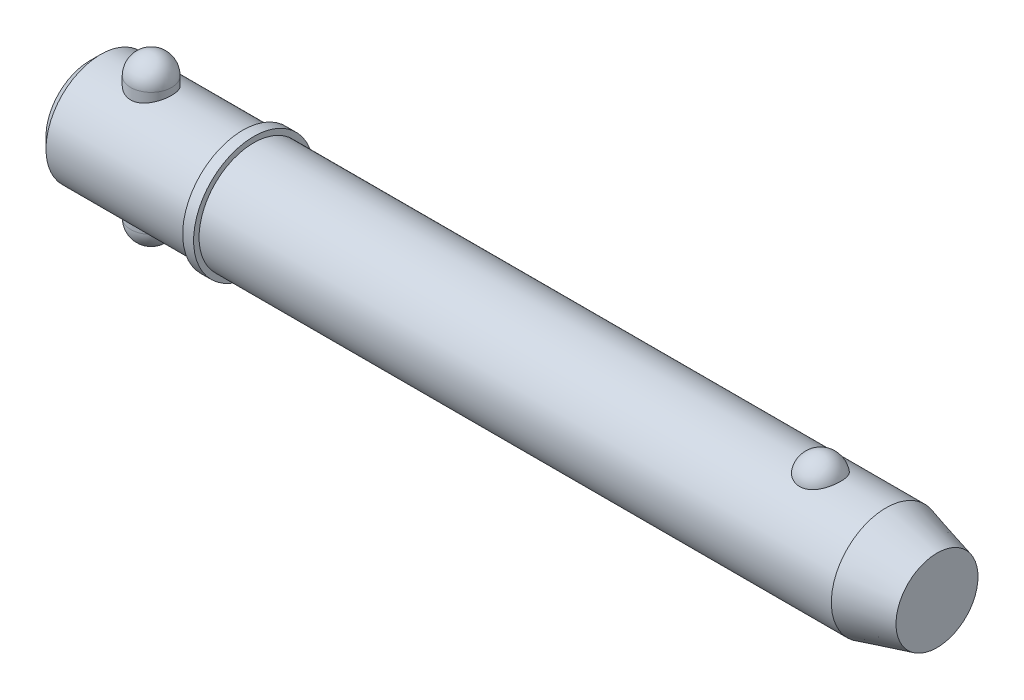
ISO-10303-21;
HEADER;
FILE_DESCRIPTION(('STEP AP214'),'2;1');
FILE_NAME('part.step','',(''),(''),'','','');
FILE_SCHEMA(('AUTOMOTIVE_DESIGN { 1 0 10303 214 1 1 1 1 }'));
ENDSEC;
DATA;
#1=APPLICATION_CONTEXT('core data for automotive mechanical design processes');
#2=APPLICATION_PROTOCOL_DEFINITION('international standard','automotive_design',2000,#1);
#3=PRODUCT_CONTEXT('',#1,'mechanical');
#4=PRODUCT('Part','Part','',(#3));
#5=PRODUCT_RELATED_PRODUCT_CATEGORY('part','',(#4));
#6=PRODUCT_DEFINITION_FORMATION('','',#4);
#7=PRODUCT_DEFINITION_CONTEXT('part definition',#1,'design');
#8=PRODUCT_DEFINITION('design','',#6,#7);
#9=PRODUCT_DEFINITION_SHAPE('','',#8);
#10=(LENGTH_UNIT() NAMED_UNIT(*) SI_UNIT(.MILLI.,.METRE.));
#11=(NAMED_UNIT(*) PLANE_ANGLE_UNIT() SI_UNIT($,.RADIAN.));
#12=(NAMED_UNIT(*) SI_UNIT($,.STERADIAN.) SOLID_ANGLE_UNIT());
#13=UNCERTAINTY_MEASURE_WITH_UNIT(LENGTH_MEASURE(1.E-05),#10,'distance_accuracy_value','');
#14=(GEOMETRIC_REPRESENTATION_CONTEXT(3) GLOBAL_UNCERTAINTY_ASSIGNED_CONTEXT((#13)) GLOBAL_UNIT_ASSIGNED_CONTEXT((#10,
#11,#12)) REPRESENTATION_CONTEXT('',''));
#15=CARTESIAN_POINT('',(0.,0.,0.));
#16=DIRECTION('',(0.,0.,1.));
#17=DIRECTION('',(1.,0.,0.));
#18=AXIS2_PLACEMENT_3D('',#15,#16,#17);
#19=CARTESIAN_POINT('',(14.28,19.05,0.));
#20=DIRECTION('',(0.,-1.,0.));
#21=DIRECTION('',(0.,0.,-1.));
#22=AXIS2_PLACEMENT_3D('',#19,#20,#21);
#23=CYLINDRICAL_SURFACE('',#22,4.76);
#24=CARTESIAN_POINT('',(14.28,-14.29,0.));
#25=DIRECTION('',(0.,-1.,0.));
#26=DIRECTION('',(0.,0.,-1.));
#27=AXIS2_PLACEMENT_3D('',#24,#25,#26);
#28=CIRCLE('',#27,4.76);
#29=CARTESIAN_POINT('',(14.28,-14.29,-4.76));
#30=VERTEX_POINT('',#29);
#31=EDGE_CURVE('P0_E10',#30,#30,#28,.F.);
#32=CARTESIAN_POINT('',(14.28,14.29,0.));
#33=DIRECTION('',(0.,-1.,0.));
#34=DIRECTION('',(0.,0.,-1.));
#35=AXIS2_PLACEMENT_3D('',#32,#33,#34);
#36=CIRCLE('',#35,4.76);
#37=CARTESIAN_POINT('',(14.28,14.29,-4.76));
#38=VERTEX_POINT('',#37);
#39=EDGE_CURVE('P0_E21',#38,#38,#36,.T.);
#40=CARTESIAN_POINT('',(14.28,-14.29,-4.76));
#41=CARTESIAN_POINT('',(14.28,-13.9922916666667,-4.76));
#42=CARTESIAN_POINT('',(14.28,-13.6945833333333,-4.76));
#43=CARTESIAN_POINT('',(14.28,-13.0991666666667,-4.76));
#44=CARTESIAN_POINT('',(14.28,-12.8014583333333,-4.76));
#45=CARTESIAN_POINT('',(14.28,-12.2060416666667,-4.76));
#46=CARTESIAN_POINT('',(14.28,-11.9083333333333,-4.76));
#47=CARTESIAN_POINT('',(14.28,-11.3129166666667,-4.76));
#48=CARTESIAN_POINT('',(14.28,-11.0152083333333,-4.76));
#49=CARTESIAN_POINT('',(14.28,-10.4197916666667,-4.76));
#50=CARTESIAN_POINT('',(14.28,-10.1220833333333,-4.76));
#51=CARTESIAN_POINT('',(14.28,-9.52666666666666,-4.76));
#52=CARTESIAN_POINT('',(14.28,-9.22895833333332,-4.76));
#53=CARTESIAN_POINT('',(14.28,-8.63354166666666,-4.76));
#54=CARTESIAN_POINT('',(14.28,-8.33583333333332,-4.76));
#55=CARTESIAN_POINT('',(14.28,-7.74041666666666,-4.76));
#56=CARTESIAN_POINT('',(14.28,-7.44270833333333,-4.76));
#57=CARTESIAN_POINT('',(14.28,-6.84729166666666,-4.76));
#58=CARTESIAN_POINT('',(14.28,-6.54958333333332,-4.76));
#59=CARTESIAN_POINT('',(14.28,-5.95416666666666,-4.76));
#60=CARTESIAN_POINT('',(14.28,-5.65645833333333,-4.76));
#61=CARTESIAN_POINT('',(14.28,-5.06104166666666,-4.76));
#62=CARTESIAN_POINT('',(14.28,-4.76333333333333,-4.76));
#63=CARTESIAN_POINT('',(14.28,-4.16791666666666,-4.76));
#64=CARTESIAN_POINT('',(14.28,-3.87020833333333,-4.76));
#65=CARTESIAN_POINT('',(14.28,-3.27479166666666,-4.76));
#66=CARTESIAN_POINT('',(14.28,-2.97708333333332,-4.76));
#67=CARTESIAN_POINT('',(14.28,-2.38166666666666,-4.76));
#68=CARTESIAN_POINT('',(14.28,-2.08395833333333,-4.76));
#69=CARTESIAN_POINT('',(14.28,-1.48854166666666,-4.76));
#70=CARTESIAN_POINT('',(14.28,-1.19083333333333,-4.76));
#71=CARTESIAN_POINT('',(14.28,-0.595416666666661,-4.76));
#72=CARTESIAN_POINT('',(14.28,-0.297708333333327,-4.76));
#73=CARTESIAN_POINT('',(14.28,0.297708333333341,-4.76));
#74=CARTESIAN_POINT('',(14.28,0.595416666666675,-4.76));
#75=CARTESIAN_POINT('',(14.28,1.19083333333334,-4.76));
#76=CARTESIAN_POINT('',(14.28,1.48854166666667,-4.76));
#77=CARTESIAN_POINT('',(14.28,2.08395833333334,-4.76));
#78=CARTESIAN_POINT('',(14.28,2.38166666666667,-4.76));
#79=CARTESIAN_POINT('',(14.28,2.97708333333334,-4.76));
#80=CARTESIAN_POINT('',(14.28,3.27479166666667,-4.76));
#81=CARTESIAN_POINT('',(14.28,3.87020833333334,-4.76));
#82=CARTESIAN_POINT('',(14.28,4.16791666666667,-4.76));
#83=CARTESIAN_POINT('',(14.28,4.76333333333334,-4.76));
#84=CARTESIAN_POINT('',(14.28,5.06104166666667,-4.76));
#85=CARTESIAN_POINT('',(14.28,5.65645833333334,-4.76));
#86=CARTESIAN_POINT('',(14.28,5.95416666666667,-4.76));
#87=CARTESIAN_POINT('',(14.28,6.54958333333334,-4.76));
#88=CARTESIAN_POINT('',(14.28,6.84729166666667,-4.76));
#89=CARTESIAN_POINT('',(14.28,7.44270833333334,-4.76));
#90=CARTESIAN_POINT('',(14.28,7.74041666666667,-4.76));
#91=CARTESIAN_POINT('',(14.28,8.33583333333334,-4.76));
#92=CARTESIAN_POINT('',(14.28,8.63354166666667,-4.76));
#93=CARTESIAN_POINT('',(14.28,9.22895833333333,-4.76));
#94=CARTESIAN_POINT('',(14.28,9.52666666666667,-4.76));
#95=CARTESIAN_POINT('',(14.28,10.1220833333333,-4.76));
#96=CARTESIAN_POINT('',(14.28,10.4197916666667,-4.76));
#97=CARTESIAN_POINT('',(14.28,11.0152083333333,-4.76));
#98=CARTESIAN_POINT('',(14.28,11.3129166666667,-4.76));
#99=CARTESIAN_POINT('',(14.28,11.9083333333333,-4.76));
#100=CARTESIAN_POINT('',(14.28,12.2060416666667,-4.76));
#101=CARTESIAN_POINT('',(14.28,12.8014583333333,-4.76));
#102=CARTESIAN_POINT('',(14.28,13.0991666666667,-4.76));
#103=CARTESIAN_POINT('',(14.28,13.6945833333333,-4.76));
#104=CARTESIAN_POINT('',(14.28,13.9922916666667,-4.76));
#105=CARTESIAN_POINT('',(14.28,14.29,-4.76));
#106=B_SPLINE_CURVE_WITH_KNOTS('',3,(#40,#41,#42,#43,#44,#45,#46,#47,#48,#49,#50,#51,#52,#53,
#54,#55,#56,#57,#58,#59,#60,#61,#62,#63,#64,#65,#66,#67,#68,#69,#70,#71,#72,#73,#74,#75,#76,#77,
#78,#79,#80,#81,#82,#83,#84,#85,#86,#87,#88,#89,#90,#91,#92,#93,#94,#95,#96,#97,#98,#99,#100,
#101,#102,#103,#104,#105),.UNSPECIFIED.,.F.,.F.,(4,2,2,2,2,2,2,2,2,2,2,2,2,2,2,2,2,2,2,2,2,2,2,
2,2,2,2,2,2,2,2,2,4),(0.,0.893125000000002,1.78625,2.67937499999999,3.5725,4.465625,5.35875,
6.25187499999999,7.145,8.038125,8.93125,9.82437499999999,10.7175,11.610625,12.50375,13.396875,
14.29,15.183125,16.07625,16.969375,17.8625,18.755625,19.64875,20.541875,21.435,22.328125,
23.22125,24.114375,25.0075,25.900625,26.79375,27.686875,28.58),.UNSPECIFIED.);
#107=EDGE_CURVE('P0_BSEAM14',#30,#38,#106,.T.);
#108=ORIENTED_EDGE('',*,*,#31,.T.);
#109=ORIENTED_EDGE('',*,*,#39,.T.);
#110=ORIENTED_EDGE('',*,*,#107,.T.);
#111=ORIENTED_EDGE('',*,*,#107,.F.);
#112=EDGE_LOOP('',(#108,#110,#109,#111));
#113=FACE_BOUND('',#112,.T.);
#114=ADVANCED_FACE('P0_F14',(#113),#23,.T.);
#115=CARTESIAN_POINT('',(14.28,-14.29,0.));
#116=DIRECTION('',(0.,0.,1.));
#117=DIRECTION('',(1.,0.,0.));
#118=AXIS2_PLACEMENT_3D('',#115,#116,#117);
#119=SPHERICAL_SURFACE('',#118,4.76);
#120=CARTESIAN_POINT('',(14.28,-14.29,0.));
#121=DIRECTION('',(0.,-1.,0.));
#122=DIRECTION('',(0.,0.,-1.));
#123=AXIS2_PLACEMENT_3D('',#120,#121,#122);
#124=SPHERICAL_SURFACE('',#123,4.76);
#125=ORIENTED_EDGE('',*,*,#31,.F.);
#126=EDGE_LOOP('',(#125));
#127=FACE_BOUND('',#126,.T.);
#128=ADVANCED_FACE('P0_F29',(#127),#124,.T.);
#129=CARTESIAN_POINT('',(14.28,14.29,0.));
#130=DIRECTION('',(0.,0.,1.));
#131=DIRECTION('',(1.,0.,0.));
#132=AXIS2_PLACEMENT_3D('',#129,#130,#131);
#133=SPHERICAL_SURFACE('',#132,4.76);
#134=CARTESIAN_POINT('',(14.28,14.29,0.));
#135=DIRECTION('',(0.,-1.,0.));
#136=DIRECTION('',(0.,0.,-1.));
#137=AXIS2_PLACEMENT_3D('',#134,#135,#136);
#138=SPHERICAL_SURFACE('',#137,4.76);
#139=ORIENTED_EDGE('',*,*,#39,.F.);
#140=EDGE_LOOP('',(#139));
#141=FACE_BOUND('',#140,.T.);
#142=ADVANCED_FACE('P0_F16',(#141),#138,.T.);
#143=CLOSED_SHELL('',(#114,#128,#142));
#144=MANIFOLD_SOLID_BREP('P0_B1',#143);
#145=CARTESIAN_POINT('',(0.,0.,0.));
#146=DIRECTION('',(1.,0.,0.));
#147=DIRECTION('',(0.,0.,-1.));
#148=AXIS2_PLACEMENT_3D('',#145,#146,#147);
#149=CYLINDRICAL_SURFACE('',#148,12.7);
#150=CARTESIAN_POINT('',(185.000738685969,0.,0.));
#151=DIRECTION('',(1.,0.,0.));
#152=DIRECTION('',(0.,0.,-1.));
#153=AXIS2_PLACEMENT_3D('',#150,#151,#152);
#154=CIRCLE('',#153,12.7);
#155=CARTESIAN_POINT('',(185.000738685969,0.,-12.7));
#156=VERTEX_POINT('',#155);
#157=EDGE_CURVE('P1_E81',#156,#156,#154,.T.);
#158=ORIENTED_EDGE('',*,*,#157,.F.);
#159=EDGE_LOOP('',(#158));
#160=FACE_BOUND('',#159,.T.);
#161=CARTESIAN_POINT('',(38.1,0.,0.));
#162=DIRECTION('',(1.,0.,0.));
#163=DIRECTION('',(0.,0.,-1.));
#164=AXIS2_PLACEMENT_3D('',#161,#162,#163);
#165=CIRCLE('',#164,12.7);
#166=CARTESIAN_POINT('',(38.1,0.,-12.7));
#167=VERTEX_POINT('',#166);
#168=EDGE_CURVE('P1_E85',#167,#167,#165,.T.);
#169=ORIENTED_EDGE('',*,*,#168,.T.);
#170=EDGE_LOOP('',(#169));
#171=FACE_BOUND('',#170,.T.);
#172=CARTESIAN_POINT('',(169.760042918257,11.7500437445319,4.81938502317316));
#173=CARTESIAN_POINT('',(169.635088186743,11.7500430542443,4.81938571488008));
#174=CARTESIAN_POINT('',(169.510144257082,11.7520975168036,4.81438658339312));
#175=CARTESIAN_POINT('',(169.261142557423,11.760253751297,4.79442904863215));
#176=CARTESIAN_POINT('',(169.137085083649,11.7663568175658,4.77946746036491));
#177=CARTESIAN_POINT('',(168.890901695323,11.7824262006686,4.73971414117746));
#178=CARTESIAN_POINT('',(168.768774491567,11.7923898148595,4.71492928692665));
#179=CARTESIAN_POINT('',(168.527187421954,11.8158938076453,4.65571340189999));
#180=CARTESIAN_POINT('',(168.40772859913,11.8294355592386,4.62127866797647));
#181=CARTESIAN_POINT('',(168.172557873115,11.8596812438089,4.54309502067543));
#182=CARTESIAN_POINT('',(168.056839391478,11.8763792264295,4.49936361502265));
#183=CARTESIAN_POINT('',(167.829653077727,11.9124878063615,4.40287235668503));
#184=CARTESIAN_POINT('',(167.718186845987,11.9318994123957,4.35010914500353));
#185=CARTESIAN_POINT('',(167.391278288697,11.9934256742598,4.17881316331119));
#186=CARTESIAN_POINT('',(167.183127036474,12.038858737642,4.04720756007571));
#187=CARTESIAN_POINT('',(166.785850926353,12.1352173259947,3.74856446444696));
#188=CARTESIAN_POINT('',(166.597443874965,12.1862630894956,3.5806182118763));
#189=CARTESIAN_POINT('',(166.250521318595,12.2875163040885,3.2160075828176));
#190=CARTESIAN_POINT('',(166.092011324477,12.3377235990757,3.01933792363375));
#191=CARTESIAN_POINT('',(165.80168878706,12.4344923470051,2.59291655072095));
#192=CARTESIAN_POINT('',(165.671376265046,12.4807925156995,2.36208286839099));
#193=CARTESIAN_POINT('',(165.449407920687,12.5623454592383,1.88070399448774));
#194=CARTESIAN_POINT('',(165.357755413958,12.5975972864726,1.63015711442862));
#195=CARTESIAN_POINT('',(165.214046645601,12.6538414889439,1.11298869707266));
#196=CARTESIAN_POINT('',(165.162499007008,12.6746503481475,0.846205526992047));
#197=CARTESIAN_POINT('',(165.101977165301,12.699153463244,0.307085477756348));
#198=CARTESIAN_POINT('',(165.093001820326,12.7028481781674,0.0347487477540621));
#199=CARTESIAN_POINT('',(165.117731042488,12.6927785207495,-0.506073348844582));
#200=CARTESIAN_POINT('',(165.151189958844,12.6791146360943,-0.774571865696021));
#201=CARTESIAN_POINT('',(165.259687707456,12.635882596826,-1.30170246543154));
#202=CARTESIAN_POINT('',(165.33472729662,12.606314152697,-1.56033436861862));
#203=CARTESIAN_POINT('',(165.52500006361,12.5342328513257,-2.06083899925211));
#204=CARTESIAN_POINT('',(165.640287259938,12.4917026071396,-2.30268867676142));
#205=CARTESIAN_POINT('',(165.908704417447,12.3981123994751,-2.76259600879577));
#206=CARTESIAN_POINT('',(166.061837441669,12.3470517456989,-2.98065173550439));
#207=CARTESIAN_POINT('',(166.403507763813,12.2416045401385,-3.38786328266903));
#208=CARTESIAN_POINT('',(166.592201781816,12.1872040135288,-3.57688418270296));
#209=CARTESIAN_POINT('',(167.000239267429,12.0814086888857,-3.91941073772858));
#210=CARTESIAN_POINT('',(167.219580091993,12.0300136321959,-4.07291945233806));
#211=CARTESIAN_POINT('',(167.678375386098,11.9373542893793,-4.33691289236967));
#212=CARTESIAN_POINT('',(167.917304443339,11.8958982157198,-4.44824125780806));
#213=CARTESIAN_POINT('',(168.41243761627,11.8268116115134,-4.62881985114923));
#214=CARTESIAN_POINT('',(168.668635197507,11.7991758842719,-4.69808589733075));
#215=CARTESIAN_POINT('',(169.177164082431,11.7622209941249,-4.78983181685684));
#216=CARTESIAN_POINT('',(169.429041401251,11.7520502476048,-4.8144902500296));
#217=CARTESIAN_POINT('',(169.933573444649,11.7485796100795,-4.82295735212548));
#218=CARTESIAN_POINT('',(170.186228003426,11.7552763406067,-4.80677420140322));
#219=CARTESIAN_POINT('',(170.676834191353,11.7842584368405,-4.73525430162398));
#220=CARTESIAN_POINT('',(170.914998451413,11.8060486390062,-4.68116061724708));
#221=CARTESIAN_POINT('',(171.378489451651,11.8622750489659,-4.53678133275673));
#222=CARTESIAN_POINT('',(171.603815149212,11.8967122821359,-4.44649279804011));
#223=CARTESIAN_POINT('',(172.040801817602,11.9754603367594,-4.22987613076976));
#224=CARTESIAN_POINT('',(172.252057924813,12.0199699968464,-4.10280539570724));
#225=CARTESIAN_POINT('',(172.650601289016,12.1138028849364,-3.81685409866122));
#226=CARTESIAN_POINT('',(172.837883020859,12.163127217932,-3.65796622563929));
#227=CARTESIAN_POINT('',(173.193350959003,12.2642343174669,-3.30364864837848));
#228=CARTESIAN_POINT('',(173.360111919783,12.3160165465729,-3.10678783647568));
#229=CARTESIAN_POINT('',(173.659579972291,12.4142566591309,-2.68748409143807));
#230=CARTESIAN_POINT('',(173.792280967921,12.4607135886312,-2.46503658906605));
#231=CARTESIAN_POINT('',(174.024691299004,12.5450236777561,-1.99289519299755));
#232=CARTESIAN_POINT('',(174.123215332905,12.5825557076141,-1.74255918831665));
#233=CARTESIAN_POINT('',(174.279227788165,12.6431720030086,-1.22773734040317));
#234=CARTESIAN_POINT('',(174.336715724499,12.6662560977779,-0.963251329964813));
#235=CARTESIAN_POINT('',(174.409544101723,12.6956486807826,-0.427355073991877));
#236=CARTESIAN_POINT('',(174.424837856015,12.7019385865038,-0.155937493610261));
#237=CARTESIAN_POINT('',(174.412779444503,12.6970201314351,0.385928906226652));
#238=CARTESIAN_POINT('',(174.38542805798,12.6858120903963,0.656377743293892));
#239=CARTESIAN_POINT('',(174.313060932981,12.6568455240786,1.05454017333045));
#240=CARTESIAN_POINT('',(174.283796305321,12.6451962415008,1.18577850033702));
#241=CARTESIAN_POINT('',(174.215022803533,12.6181819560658,1.44513808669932));
#242=CARTESIAN_POINT('',(174.175517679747,12.6028183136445,1.57326046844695));
#243=CARTESIAN_POINT('',(174.086439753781,12.568754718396,1.82554978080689));
#244=CARTESIAN_POINT('',(174.036862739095,12.5500533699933,1.94971503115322));
#245=CARTESIAN_POINT('',(173.92792115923,12.5098093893,2.19314370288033));
#246=CARTESIAN_POINT('',(173.868560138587,12.4882677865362,2.31240887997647));
#247=CARTESIAN_POINT('',(173.73997128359,12.4427679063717,2.5459303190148));
#248=CARTESIAN_POINT('',(173.670688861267,12.4187964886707,2.66015396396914));
#249=CARTESIAN_POINT('',(173.522903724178,12.3691892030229,2.882026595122));
#250=CARTESIAN_POINT('',(173.444404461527,12.3435539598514,2.98967802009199));
#251=CARTESIAN_POINT('',(173.27855022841,12.2912955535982,3.1977438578));
#252=CARTESIAN_POINT('',(173.191191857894,12.2646720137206,3.29815546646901));
#253=CARTESIAN_POINT('',(173.008161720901,12.2111945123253,3.49095035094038));
#254=CARTESIAN_POINT('',(172.912493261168,12.1843406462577,3.58333679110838));
#255=CARTESIAN_POINT('',(172.713627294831,12.1312249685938,3.75922876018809));
#256=CARTESIAN_POINT('',(172.610450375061,12.104961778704,3.84275713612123));
#257=CARTESIAN_POINT('',(172.39701336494,12.0537284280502,4.00056406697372));
#258=CARTESIAN_POINT('',(172.286756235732,12.028757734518,4.07484645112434));
#259=CARTESIAN_POINT('',(172.059755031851,11.9808306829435,4.21367959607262));
#260=CARTESIAN_POINT('',(171.943006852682,11.9578756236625,4.27822410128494));
#261=CARTESIAN_POINT('',(171.70394258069,11.9147184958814,4.39698483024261));
#262=CARTESIAN_POINT('',(171.581628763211,11.894515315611,4.45120522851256));
#263=CARTESIAN_POINT('',(171.322952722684,11.8561129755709,4.55255353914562));
#264=CARTESIAN_POINT('',(171.186223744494,11.8381764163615,4.59884858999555));
#265=CARTESIAN_POINT('',(170.908608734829,11.8069093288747,4.67853897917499));
#266=CARTESIAN_POINT('',(170.767724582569,11.7935767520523,4.71194005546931));
#267=CARTESIAN_POINT('',(170.48309446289,11.7720277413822,4.7655218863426));
#268=CARTESIAN_POINT('',(170.339348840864,11.7638106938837,4.7857042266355));
#269=CARTESIAN_POINT('',(170.050411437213,11.7528195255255,4.81263433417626));
#270=CARTESIAN_POINT('',(169.905219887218,11.7500445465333,4.81938421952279));
#271=CARTESIAN_POINT('',(169.760042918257,11.7500437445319,4.81938502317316));
#272=B_SPLINE_CURVE_WITH_KNOTS('',3,(#172,#173,#174,#175,#176,#177,#178,#179,#180,#181,#182,
#183,#184,#185,#186,#187,#188,#189,#190,#191,#192,#193,#194,#195,#196,#197,#198,#199,#200,#201,
#202,#203,#204,#205,#206,#207,#208,#209,#210,#211,#212,#213,#214,#215,#216,#217,#218,#219,#220,
#221,#222,#223,#224,#225,#226,#227,#228,#229,#230,#231,#232,#233,#234,#235,#236,#237,#238,#239,
#240,#241,#242,#243,#244,#245,#246,#247,#248,#249,#250,#251,#252,#253,#254,#255,#256,#257,#258,
#259,#260,#261,#262,#263,#264,#265,#266,#267,#268,#269,#270,#271),.UNSPECIFIED.,.T.,.F.,(4,2,2,
2,2,2,2,2,2,2,2,2,2,2,2,2,2,2,2,2,2,2,2,2,2,2,2,2,2,2,2,2,2,2,2,2,2,2,2,2,2,2,2,2,2,2,2,2,2,4),
(0.,0.374729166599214,0.749578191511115,1.12416526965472,1.49889629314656,1.87292776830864,
2.24709865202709,2.99481328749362,3.76399449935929,4.53331735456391,5.33683915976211,
6.14042986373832,6.95405296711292,7.76765424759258,8.57656703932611,9.38549455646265,
10.1955119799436,11.0055949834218,11.8193353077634,12.6330054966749,13.4294141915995,
14.2255231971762,14.9815786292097,15.7374826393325,16.4696948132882,17.2019663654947,
17.950197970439,18.6986017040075,19.484470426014,20.2704797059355,21.0815215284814,
21.8925729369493,22.7045213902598,23.5164550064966,23.9209608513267,24.3253187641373,
24.7298461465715,25.1342272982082,25.5409255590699,25.9474719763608,26.3541750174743,
26.760716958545,27.1661834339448,27.5714814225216,27.9770386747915,28.382431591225,
28.8181206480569,29.2536155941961,29.6890582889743,30.1244323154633),.UNSPECIFIED.);
#273=CARTESIAN_POINT('',(169.760042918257,11.7500437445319,4.81938502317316));
#274=VERTEX_POINT('',#273);
#275=EDGE_CURVE('P1_E35',#274,#274,#272,.T.);
#276=ORIENTED_EDGE('',*,*,#275,.T.);
#277=EDGE_LOOP('',(#276));
#278=FACE_BOUND('',#277,.T.);
#279=ADVANCED_FACE('P1_F13',(#160,#171,#278),#149,.T.);
#280=CARTESIAN_POINT('',(0.,0.,0.));
#281=DIRECTION('',(-1.,0.,0.));
#282=DIRECTION('',(0.,0.,1.));
#283=AXIS2_PLACEMENT_3D('',#280,#281,#282);
#284=PLANE('',#283);
#285=CARTESIAN_POINT('',(0.,0.,0.));
#286=DIRECTION('',(1.,0.,0.));
#287=DIRECTION('',(0.,0.,-1.));
#288=AXIS2_PLACEMENT_3D('',#285,#286,#287);
#289=CIRCLE('',#288,10.16);
#290=CARTESIAN_POINT('',(0.,0.,-10.16));
#291=VERTEX_POINT('',#290);
#292=EDGE_CURVE('P1_E9',#291,#291,#289,.T.);
#293=ORIENTED_EDGE('',*,*,#292,.F.);
#294=EDGE_LOOP('',(#293));
#295=FACE_BOUND('',#294,.T.);
#296=ADVANCED_FACE('P1_F15',(#295),#284,.T.);
#297=CARTESIAN_POINT('',(2.53999999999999,0.,0.));
#298=DIRECTION('',(1.,0.,0.));
#299=DIRECTION('',(0.,0.,-1.));
#300=AXIS2_PLACEMENT_3D('',#297,#298,#299);
#301=CONICAL_SURFACE('',#300,12.7,0.78539816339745);
#302=ORIENTED_EDGE('',*,*,#292,.T.);
#303=EDGE_LOOP('',(#302));
#304=FACE_BOUND('',#303,.T.);
#305=CARTESIAN_POINT('',(2.53999999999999,0.,0.));
#306=DIRECTION('',(1.,0.,0.));
#307=DIRECTION('',(0.,0.,-1.));
#308=AXIS2_PLACEMENT_3D('',#305,#306,#307);
#309=CIRCLE('',#308,12.7);
#310=CARTESIAN_POINT('',(2.53999999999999,0.,-12.7));
#311=VERTEX_POINT('',#310);
#312=EDGE_CURVE('P1_E26',#311,#311,#309,.T.);
#313=ORIENTED_EDGE('',*,*,#312,.F.);
#314=EDGE_LOOP('',(#313));
#315=FACE_BOUND('',#314,.T.);
#316=ADVANCED_FACE('P1_F77',(#304,#315),#301,.T.);
#317=CARTESIAN_POINT('',(0.,0.,0.));
#318=DIRECTION('',(1.,0.,0.));
#319=DIRECTION('',(0.,0.,-1.));
#320=AXIS2_PLACEMENT_3D('',#317,#318,#319);
#321=CYLINDRICAL_SURFACE('',#320,12.7);
#322=CARTESIAN_POINT('',(14.28,-11.7742260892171,4.76));
#323=CARTESIAN_POINT('',(14.1514948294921,-11.7742255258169,4.76000061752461));
#324=CARTESIAN_POINT('',(14.0229980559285,-11.7763355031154,4.75479194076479));
#325=CARTESIAN_POINT('',(13.7669369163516,-11.7847043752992,4.73401198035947));
#326=CARTESIAN_POINT('',(13.6393728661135,-11.7909646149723,4.71843733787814));
#327=CARTESIAN_POINT('',(13.386226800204,-11.8074248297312,4.67709434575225));
#328=CARTESIAN_POINT('',(13.2606439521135,-11.8176231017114,4.65133040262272));
#329=CARTESIAN_POINT('',(13.0122434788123,-11.8416347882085,4.58985545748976));
#330=CARTESIAN_POINT('',(12.8894269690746,-11.8554496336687,4.55414051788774));
#331=CARTESIAN_POINT('',(12.6477622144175,-11.8862222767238,4.47320764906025));
#332=CARTESIAN_POINT('',(12.5289037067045,-11.9031710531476,4.4280169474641));
#333=CARTESIAN_POINT('',(12.2955059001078,-11.939736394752,4.32845291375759));
#334=CARTESIAN_POINT('',(12.1809682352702,-11.9593539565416,4.2740761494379));
#335=CARTESIAN_POINT('',(11.8448901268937,-12.0213893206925,4.09777237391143));
#336=CARTESIAN_POINT('',(11.6307077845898,-12.0670135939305,3.9626122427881));
#337=CARTESIAN_POINT('',(11.2179129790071,-12.1641514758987,3.65386230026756));
#338=CARTESIAN_POINT('',(11.0204399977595,-12.2158379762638,3.47881300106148));
#339=CARTESIAN_POINT('',(10.6568212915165,-12.3178468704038,3.09829182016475));
#340=CARTESIAN_POINT('',(10.4906822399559,-12.3681689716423,2.89281347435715));
#341=CARTESIAN_POINT('',(10.1890299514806,-12.4638367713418,2.44867909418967));
#342=CARTESIAN_POINT('',(10.054749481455,-12.5089552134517,2.20913281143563));
#343=CARTESIAN_POINT('',(9.82886079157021,-12.5870472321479,1.70885919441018));
#344=CARTESIAN_POINT('',(9.73723778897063,-12.620025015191,1.44813923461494));
#345=CARTESIAN_POINT('',(9.60324488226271,-12.6688874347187,0.9248423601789));
#346=CARTESIAN_POINT('',(9.55892269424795,-12.6854474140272,0.662829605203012));
#347=CARTESIAN_POINT('',(9.5145335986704,-12.7020320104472,0.134596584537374));
#348=CARTESIAN_POINT('',(9.5144523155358,-12.7020619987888,-0.131622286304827));
#349=CARTESIAN_POINT('',(9.55741019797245,-12.6860129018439,-0.646717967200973));
#350=CARTESIAN_POINT('',(9.59831845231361,-12.6707298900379,-0.895801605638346));
#351=CARTESIAN_POINT('',(9.71850987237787,-12.6268158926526,-1.38327219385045));
#352=CARTESIAN_POINT('',(9.79779575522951,-12.5981839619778,-1.62165838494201));
#353=CARTESIAN_POINT('',(9.99348296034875,-12.5298894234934,-2.08508424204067));
#354=CARTESIAN_POINT('',(10.110407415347,-12.4900724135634,-2.30987931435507));
#355=CARTESIAN_POINT('',(10.3775896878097,-12.4034373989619,-2.7372158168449));
#356=CARTESIAN_POINT('',(10.5278582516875,-12.3566171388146,-2.93975004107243));
#357=CARTESIAN_POINT('',(10.8677318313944,-12.257571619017,-3.32936830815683));
#358=CARTESIAN_POINT('',(11.0591227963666,-12.2051903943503,-3.51485714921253));
#359=CARTESIAN_POINT('',(11.4706087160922,-12.1031155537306,-3.85170663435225));
#360=CARTESIAN_POINT('',(11.6907108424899,-12.0534226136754,-4.00305872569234));
#361=CARTESIAN_POINT('',(12.1596597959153,-11.9613684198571,-4.27038218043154));
#362=CARTESIAN_POINT('',(12.4090353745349,-11.9191939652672,-4.38549550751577));
#363=CARTESIAN_POINT('',(12.9256290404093,-11.8491124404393,-4.57149117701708));
#364=CARTESIAN_POINT('',(13.1928371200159,-11.8211974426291,-4.64239810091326));
#365=CARTESIAN_POINT('',(13.7217488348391,-11.7846654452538,-4.73434137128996));
#366=CARTESIAN_POINT('',(13.9829438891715,-11.7750694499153,-4.75791141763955));
#367=CARTESIAN_POINT('',(14.5056760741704,-11.7734909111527,-4.76182097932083));
#368=CARTESIAN_POINT('',(14.7672131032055,-11.7815039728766,-4.74217128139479));
#369=CARTESIAN_POINT('',(15.2702140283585,-11.8132466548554,-4.66249544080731));
#370=CARTESIAN_POINT('',(15.5120417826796,-11.8362133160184,-4.60442726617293));
#371=CARTESIAN_POINT('',(15.9824097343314,-11.8943704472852,-4.45202868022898));
#372=CARTESIAN_POINT('',(16.2109472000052,-11.9295634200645,-4.35769084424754));
#373=CARTESIAN_POINT('',(16.6577741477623,-12.0098310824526,-4.13144368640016));
#374=CARTESIAN_POINT('',(16.8753590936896,-12.055226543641,-3.99825937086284));
#375=CARTESIAN_POINT('',(17.2859732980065,-12.150238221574,-3.69949845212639));
#376=CARTESIAN_POINT('',(17.4789935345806,-12.19985597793,-3.5339100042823));
#377=CARTESIAN_POINT('',(17.8477707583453,-12.3015434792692,-3.1624728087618));
#378=CARTESIAN_POINT('',(18.0216609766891,-12.3535695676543,-2.95473880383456));
#379=CARTESIAN_POINT('',(18.254545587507,-12.426745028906,-2.62277433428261));
#380=CARTESIAN_POINT('',(18.3275489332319,-12.4503382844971,-2.50865480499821));
#381=CARTESIAN_POINT('',(18.463723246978,-12.4952713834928,-2.27428971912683));
#382=CARTESIAN_POINT('',(18.5268984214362,-12.5166121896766,-2.15404681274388));
#383=CARTESIAN_POINT('',(18.6427140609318,-12.5563817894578,-1.90858448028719));
#384=CARTESIAN_POINT('',(18.6953855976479,-12.5748191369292,-1.78338108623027));
#385=CARTESIAN_POINT('',(18.7899337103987,-12.6083284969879,-1.52857834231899));
#386=CARTESIAN_POINT('',(18.8318147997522,-12.6234019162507,-1.39898085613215));
#387=CARTESIAN_POINT('',(18.9043819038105,-12.6497495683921,-1.13633254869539));
#388=CARTESIAN_POINT('',(18.9350698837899,-12.6610244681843,-1.00328233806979));
#389=CARTESIAN_POINT('',(18.9849303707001,-12.6794412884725,-0.734761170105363));
#390=CARTESIAN_POINT('',(19.0041035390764,-12.6865834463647,-0.59929035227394));
#391=CARTESIAN_POINT('',(19.0299427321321,-12.6962286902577,-0.335006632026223));
#392=CARTESIAN_POINT('',(19.0372742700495,-12.698978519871,-0.206267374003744));
#393=CARTESIAN_POINT('',(19.0414668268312,-12.7005496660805,0.0514515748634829));
#394=CARTESIAN_POINT('',(19.038324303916,-12.69936965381,0.180431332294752));
#395=CARTESIAN_POINT('',(19.0215965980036,-12.6931114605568,0.437551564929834));
#396=CARTESIAN_POINT('',(19.0080165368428,-12.6880351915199,0.565692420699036));
#397=CARTESIAN_POINT('',(18.9705519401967,-12.6741222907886,0.820297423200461));
#398=CARTESIAN_POINT('',(18.9466635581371,-12.665284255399,0.946760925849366));
#399=CARTESIAN_POINT('',(18.8895279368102,-12.6443449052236,1.19395899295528));
#400=CARTESIAN_POINT('',(18.8565273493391,-12.6323299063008,1.3147578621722));
#401=CARTESIAN_POINT('',(18.781239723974,-12.6052503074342,1.55308888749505));
#402=CARTESIAN_POINT('',(18.738949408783,-12.5901846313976,1.67061987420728));
#403=CARTESIAN_POINT('',(18.5986461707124,-12.5409473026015,2.01714406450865));
#404=CARTESIAN_POINT('',(18.4871532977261,-12.502717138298,2.24027279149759));
#405=CARTESIAN_POINT('',(18.2262440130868,-12.4173042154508,2.6742599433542));
#406=CARTESIAN_POINT('',(18.0754310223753,-12.3698127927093,2.88420891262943));
#407=CARTESIAN_POINT('',(17.7421836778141,-12.271667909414,3.27675114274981));
#408=CARTESIAN_POINT('',(17.5597380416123,-12.2210133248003,3.45933459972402));
#409=CARTESIAN_POINT('',(17.2605468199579,-12.1452079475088,3.7138066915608));
#410=CARTESIAN_POINT('',(17.1535518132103,-12.119328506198,3.79719993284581));
#411=CARTESIAN_POINT('',(16.9326449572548,-12.0688597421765,3.95467398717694));
#412=CARTESIAN_POINT('',(16.8187356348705,-12.0442699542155,4.02875817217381));
#413=CARTESIAN_POINT('',(16.5846234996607,-11.9971053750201,4.16711104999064));
#414=CARTESIAN_POINT('',(16.4644172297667,-11.9745317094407,4.23137427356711));
#415=CARTESIAN_POINT('',(16.2185866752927,-11.9321360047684,4.34949041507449));
#416=CARTESIAN_POINT('',(16.09296473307,-11.9123127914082,4.40334777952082));
#417=CARTESIAN_POINT('',(15.8314769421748,-11.875268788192,4.50232278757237));
#418=CARTESIAN_POINT('',(15.6954035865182,-11.8582009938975,4.54695127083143));
#419=CARTESIAN_POINT('',(15.4194002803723,-11.8284328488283,4.62383807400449));
#420=CARTESIAN_POINT('',(15.2794720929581,-11.815730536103,4.6561019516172));
#421=CARTESIAN_POINT('',(14.9969657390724,-11.7951940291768,4.70788444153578));
#422=CARTESIAN_POINT('',(14.8543884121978,-11.7873583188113,4.72740702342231));
#423=CARTESIAN_POINT('',(14.5678704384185,-11.7768749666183,4.75346370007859));
#424=CARTESIAN_POINT('',(14.4239299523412,-11.7742267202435,4.75999930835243));
#425=CARTESIAN_POINT('',(14.28,-11.7742260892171,4.76));
#426=B_SPLINE_CURVE_WITH_KNOTS('',3,(#322,#323,#324,#325,#326,#327,#328,#329,#330,#331,#332,
#333,#334,#335,#336,#337,#338,#339,#340,#341,#342,#343,#344,#345,#346,#347,#348,#349,#350,#351,
#352,#353,#354,#355,#356,#357,#358,#359,#360,#361,#362,#363,#364,#365,#366,#367,#368,#369,#370,
#371,#372,#373,#374,#375,#376,#377,#378,#379,#380,#381,#382,#383,#384,#385,#386,#387,#388,#389,
#390,#391,#392,#393,#394,#395,#396,#397,#398,#399,#400,#401,#402,#403,#404,#405,#406,#407,#408,
#409,#410,#411,#412,#413,#414,#415,#416,#417,#418,#419,#420,#421,#422,#423,#424,#425),
.UNSPECIFIED.,.T.,.F.,(4,2,2,2,2,2,2,2,2,2,2,2,2,2,2,2,2,2,2,2,2,2,2,2,2,2,2,2,2,2,2,2,2,2,2,2,
2,2,2,2,2,2,2,2,2,2,2,2,2,2,2,4),(0.,0.385378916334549,0.770882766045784,1.15622008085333,
1.54171009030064,1.92610725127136,2.31064835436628,3.07917291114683,3.88239385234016,
4.68578566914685,5.51648193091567,6.34689010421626,7.14151420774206,7.93588010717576,
8.69098665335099,9.44614666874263,10.2122918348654,10.9786842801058,11.789876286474,
12.6012713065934,13.4306405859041,14.2595482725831,15.0427613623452,15.8257790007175,
16.5716820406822,17.3177378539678,18.0917395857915,18.8660247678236,19.6893332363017,
20.1014571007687,20.5134040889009,20.9241137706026,21.3346513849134,21.7451168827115,
22.1555587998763,22.542011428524,22.928594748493,23.3149884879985,23.7015265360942,
24.0784835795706,24.4555738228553,25.2091300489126,25.994347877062,26.7798463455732,
27.1937428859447,27.6074890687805,28.0214648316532,28.4352633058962,28.8672794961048,
29.299101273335,29.7307884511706,30.1624253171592),.UNSPECIFIED.);
#427=CARTESIAN_POINT('',(14.28,-11.7742260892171,4.76));
#428=VERTEX_POINT('',#427);
#429=EDGE_CURVE('P1_E17',#428,#428,#426,.T.);
#430=ORIENTED_EDGE('',*,*,#429,.F.);
#431=EDGE_LOOP('',(#430));
#432=FACE_BOUND('',#431,.T.);
#433=CARTESIAN_POINT('',(14.28,11.7742260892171,4.76));
#434=CARTESIAN_POINT('',(14.4085051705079,11.7742255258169,4.76000061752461));
#435=CARTESIAN_POINT('',(14.5370019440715,11.7763355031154,4.75479194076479));
#436=CARTESIAN_POINT('',(14.7930630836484,11.7847043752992,4.73401198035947));
#437=CARTESIAN_POINT('',(14.9206271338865,11.7909646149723,4.71843733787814));
#438=CARTESIAN_POINT('',(15.173773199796,11.8074248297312,4.67709434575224));
#439=CARTESIAN_POINT('',(15.2993560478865,11.8176231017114,4.65133040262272));
#440=CARTESIAN_POINT('',(15.5477565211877,11.8416347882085,4.58985545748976));
#441=CARTESIAN_POINT('',(15.6705730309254,11.8554496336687,4.55414051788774));
#442=CARTESIAN_POINT('',(15.9122377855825,11.8862222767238,4.47320764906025));
#443=CARTESIAN_POINT('',(16.0310962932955,11.9031710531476,4.4280169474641));
#444=CARTESIAN_POINT('',(16.2644940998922,11.939736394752,4.32845291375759));
#445=CARTESIAN_POINT('',(16.3790317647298,11.9593539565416,4.2740761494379));
#446=CARTESIAN_POINT('',(16.7151098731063,12.0213893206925,4.09777237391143));
#447=CARTESIAN_POINT('',(16.9292922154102,12.0670135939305,3.96261224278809));
#448=CARTESIAN_POINT('',(17.3420870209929,12.1641514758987,3.65386230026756));
#449=CARTESIAN_POINT('',(17.5395600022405,12.2158379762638,3.47881300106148));
#450=CARTESIAN_POINT('',(17.9031787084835,12.3178468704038,3.09829182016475));
#451=CARTESIAN_POINT('',(18.0693177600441,12.3681689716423,2.89281347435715));
#452=CARTESIAN_POINT('',(18.3709700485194,12.4638367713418,2.44867909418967));
#453=CARTESIAN_POINT('',(18.505250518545,12.5089552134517,2.20913281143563));
#454=CARTESIAN_POINT('',(18.7311392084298,12.5870472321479,1.70885919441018));
#455=CARTESIAN_POINT('',(18.8227622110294,12.620025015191,1.44813923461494));
#456=CARTESIAN_POINT('',(18.9567551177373,12.6688874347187,0.924842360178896));
#457=CARTESIAN_POINT('',(19.0010773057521,12.6854474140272,0.662829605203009));
#458=CARTESIAN_POINT('',(19.0454664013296,12.7020320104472,0.134596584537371));
#459=CARTESIAN_POINT('',(19.0455476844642,12.7020619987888,-0.13162228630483));
#460=CARTESIAN_POINT('',(19.0025898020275,12.6860129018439,-0.646717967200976));
#461=CARTESIAN_POINT('',(18.9616815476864,12.6707298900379,-0.89580160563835));
#462=CARTESIAN_POINT('',(18.8414901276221,12.6268158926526,-1.38327219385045));
#463=CARTESIAN_POINT('',(18.7622042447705,12.5981839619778,-1.62165838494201));
#464=CARTESIAN_POINT('',(18.5665170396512,12.5298894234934,-2.08508424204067));
#465=CARTESIAN_POINT('',(18.449592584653,12.4900724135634,-2.30987931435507));
#466=CARTESIAN_POINT('',(18.1824103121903,12.4034373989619,-2.7372158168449));
#467=CARTESIAN_POINT('',(18.0321417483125,12.3566171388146,-2.93975004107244));
#468=CARTESIAN_POINT('',(17.6922681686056,12.257571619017,-3.32936830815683));
#469=CARTESIAN_POINT('',(17.5008772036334,12.2051903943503,-3.51485714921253));
#470=CARTESIAN_POINT('',(17.0893912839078,12.1031155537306,-3.85170663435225));
#471=CARTESIAN_POINT('',(16.8692891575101,12.0534226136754,-4.00305872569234));
#472=CARTESIAN_POINT('',(16.4003402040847,11.9613684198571,-4.27038218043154));
#473=CARTESIAN_POINT('',(16.1509646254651,11.9191939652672,-4.38549550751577));
#474=CARTESIAN_POINT('',(15.6343709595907,11.8491124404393,-4.57149117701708));
#475=CARTESIAN_POINT('',(15.367162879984,11.8211974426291,-4.64239810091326));
#476=CARTESIAN_POINT('',(14.8382511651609,11.7846654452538,-4.73434137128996));
#477=CARTESIAN_POINT('',(14.5770561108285,11.7750694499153,-4.75791141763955));
#478=CARTESIAN_POINT('',(14.0543239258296,11.7734909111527,-4.76182097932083));
#479=CARTESIAN_POINT('',(13.7927868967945,11.7815039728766,-4.74217128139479));
#480=CARTESIAN_POINT('',(13.2897859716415,11.8132466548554,-4.66249544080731));
#481=CARTESIAN_POINT('',(13.0479582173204,11.8362133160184,-4.60442726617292));
#482=CARTESIAN_POINT('',(12.5775902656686,11.8943704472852,-4.45202868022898));
#483=CARTESIAN_POINT('',(12.3490527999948,11.9295634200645,-4.35769084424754));
#484=CARTESIAN_POINT('',(11.9022258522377,12.0098310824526,-4.13144368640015));
#485=CARTESIAN_POINT('',(11.6846409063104,12.055226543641,-3.99825937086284));
#486=CARTESIAN_POINT('',(11.2740267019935,12.150238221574,-3.69949845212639));
#487=CARTESIAN_POINT('',(11.0810064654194,12.19985597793,-3.5339100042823));
#488=CARTESIAN_POINT('',(10.7122292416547,12.3015434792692,-3.1624728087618));
#489=CARTESIAN_POINT('',(10.5383390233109,12.3535695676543,-2.95473880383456));
#490=CARTESIAN_POINT('',(10.305454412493,12.426745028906,-2.6227743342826));
#491=CARTESIAN_POINT('',(10.2324510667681,12.4503382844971,-2.50865480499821));
#492=CARTESIAN_POINT('',(10.096276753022,12.4952713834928,-2.27428971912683));
#493=CARTESIAN_POINT('',(10.0331015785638,12.5166121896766,-2.15404681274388));
#494=CARTESIAN_POINT('',(9.91728593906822,12.5563817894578,-1.90858448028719));
#495=CARTESIAN_POINT('',(9.8646144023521,12.5748191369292,-1.78338108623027));
#496=CARTESIAN_POINT('',(9.77006628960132,12.6083284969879,-1.52857834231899));
#497=CARTESIAN_POINT('',(9.72818520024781,12.6234019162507,-1.39898085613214));
#498=CARTESIAN_POINT('',(9.65561809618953,12.6497495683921,-1.13633254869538));
#499=CARTESIAN_POINT('',(9.62493011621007,12.6610244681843,-1.00328233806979));
#500=CARTESIAN_POINT('',(9.57506962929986,12.6794412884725,-0.734761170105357));
#501=CARTESIAN_POINT('',(9.55589646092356,12.6865834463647,-0.599290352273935));
#502=CARTESIAN_POINT('',(9.53005726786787,12.6962286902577,-0.335006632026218));
#503=CARTESIAN_POINT('',(9.52272572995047,12.698978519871,-0.20626737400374));
#504=CARTESIAN_POINT('',(9.51853317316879,12.7005496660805,0.0514515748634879));
#505=CARTESIAN_POINT('',(9.52167569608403,12.69936965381,0.180431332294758));
#506=CARTESIAN_POINT('',(9.53840340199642,12.6931114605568,0.43755156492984));
#507=CARTESIAN_POINT('',(9.55198346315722,12.6880351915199,0.565692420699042));
#508=CARTESIAN_POINT('',(9.58944805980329,12.6741222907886,0.820297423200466));
#509=CARTESIAN_POINT('',(9.61333644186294,12.665284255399,0.946760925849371));
#510=CARTESIAN_POINT('',(9.67047206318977,12.6443449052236,1.19395899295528));
#511=CARTESIAN_POINT('',(9.7034726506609,12.6323299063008,1.31475786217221));
#512=CARTESIAN_POINT('',(9.77876027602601,12.6052503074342,1.55308888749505));
#513=CARTESIAN_POINT('',(9.82105059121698,12.5901846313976,1.67061987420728));
#514=CARTESIAN_POINT('',(9.96135382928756,12.5409473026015,2.01714406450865));
#515=CARTESIAN_POINT('',(10.0728467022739,12.502717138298,2.24027279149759));
#516=CARTESIAN_POINT('',(10.3337559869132,12.4173042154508,2.6742599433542));
#517=CARTESIAN_POINT('',(10.4845689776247,12.3698127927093,2.88420891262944));
#518=CARTESIAN_POINT('',(10.8178163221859,12.271667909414,3.27675114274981));
#519=CARTESIAN_POINT('',(11.0002619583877,12.2210133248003,3.45933459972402));
#520=CARTESIAN_POINT('',(11.2994531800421,12.1452079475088,3.7138066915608));
#521=CARTESIAN_POINT('',(11.4064481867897,12.119328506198,3.79719993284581));
#522=CARTESIAN_POINT('',(11.6273550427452,12.0688597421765,3.95467398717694));
#523=CARTESIAN_POINT('',(11.7412643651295,12.0442699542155,4.02875817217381));
#524=CARTESIAN_POINT('',(11.9753765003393,11.9971053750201,4.16711104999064));
#525=CARTESIAN_POINT('',(12.0955827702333,11.9745317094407,4.23137427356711));
#526=CARTESIAN_POINT('',(12.3414133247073,11.9321360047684,4.34949041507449));
#527=CARTESIAN_POINT('',(12.46703526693,11.9123127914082,4.40334777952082));
#528=CARTESIAN_POINT('',(12.7285230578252,11.875268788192,4.50232278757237));
#529=CARTESIAN_POINT('',(12.8645964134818,11.8582009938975,4.54695127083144));
#530=CARTESIAN_POINT('',(13.1405997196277,11.8284328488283,4.62383807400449));
#531=CARTESIAN_POINT('',(13.2805279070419,11.815730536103,4.6561019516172));
#532=CARTESIAN_POINT('',(13.5630342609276,11.7951940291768,4.70788444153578));
#533=CARTESIAN_POINT('',(13.7056115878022,11.7873583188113,4.72740702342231));
#534=CARTESIAN_POINT('',(13.9921295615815,11.7768749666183,4.75346370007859));
#535=CARTESIAN_POINT('',(14.1360700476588,11.7742267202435,4.75999930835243));
#536=CARTESIAN_POINT('',(14.28,11.7742260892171,4.76));
#537=B_SPLINE_CURVE_WITH_KNOTS('',3,(#433,#434,#435,#436,#437,#438,#439,#440,#441,#442,#443,
#444,#445,#446,#447,#448,#449,#450,#451,#452,#453,#454,#455,#456,#457,#458,#459,#460,#461,#462,
#463,#464,#465,#466,#467,#468,#469,#470,#471,#472,#473,#474,#475,#476,#477,#478,#479,#480,#481,
#482,#483,#484,#485,#486,#487,#488,#489,#490,#491,#492,#493,#494,#495,#496,#497,#498,#499,#500,
#501,#502,#503,#504,#505,#506,#507,#508,#509,#510,#511,#512,#513,#514,#515,#516,#517,#518,#519,
#520,#521,#522,#523,#524,#525,#526,#527,#528,#529,#530,#531,#532,#533,#534,#535,#536),
.UNSPECIFIED.,.T.,.F.,(4,2,2,2,2,2,2,2,2,2,2,2,2,2,2,2,2,2,2,2,2,2,2,2,2,2,2,2,2,2,2,2,2,2,2,2,
2,2,2,2,2,2,2,2,2,2,2,2,2,2,2,4),(0.,0.385378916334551,0.770882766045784,1.15622008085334,
1.54171009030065,1.92610725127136,2.31064835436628,3.07917291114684,3.88239385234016,
4.68578566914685,5.51648193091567,6.34689010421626,7.14151420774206,7.93588010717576,
8.690986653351,9.44614666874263,10.2122918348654,10.9786842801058,11.789876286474,
12.6012713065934,13.4306405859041,14.2595482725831,15.0427613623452,15.8257790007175,
16.5716820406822,17.3177378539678,18.0917395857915,18.8660247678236,19.6893332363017,
20.1014571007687,20.5134040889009,20.9241137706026,21.3346513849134,21.7451168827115,
22.1555587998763,22.542011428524,22.928594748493,23.3149884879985,23.7015265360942,
24.0784835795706,24.4555738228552,25.2091300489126,25.994347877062,26.7798463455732,
27.1937428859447,27.6074890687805,28.0214648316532,28.4352633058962,28.8672794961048,
29.299101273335,29.7307884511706,30.1624253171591),.UNSPECIFIED.);
#538=CARTESIAN_POINT('',(14.28,11.7742260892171,4.76));
#539=VERTEX_POINT('',#538);
#540=EDGE_CURVE('P1_E43',#539,#539,#537,.T.);
#541=ORIENTED_EDGE('',*,*,#540,.F.);
#542=EDGE_LOOP('',(#541));
#543=FACE_BOUND('',#542,.T.);
#544=ORIENTED_EDGE('',*,*,#312,.T.);
#545=EDGE_LOOP('',(#544));
#546=FACE_BOUND('',#545,.T.);
#547=CARTESIAN_POINT('',(35.56,0.,0.));
#548=DIRECTION('',(1.,0.,0.));
#549=DIRECTION('',(0.,0.,-1.));
#550=AXIS2_PLACEMENT_3D('',#547,#548,#549);
#551=CIRCLE('',#550,12.7);
#552=CARTESIAN_POINT('',(35.56,0.,-12.7));
#553=VERTEX_POINT('',#552);
#554=EDGE_CURVE('P1_E31',#553,#553,#551,.T.);
#555=ORIENTED_EDGE('',*,*,#554,.F.);
#556=EDGE_LOOP('',(#555));
#557=FACE_BOUND('',#556,.T.);
#558=ADVANCED_FACE('P1_F103',(#432,#543,#546,#557),#321,.T.);
#559=CARTESIAN_POINT('',(35.56,12.7,0.));
#560=DIRECTION('',(-1.,0.,0.));
#561=DIRECTION('',(0.,0.,1.));
#562=AXIS2_PLACEMENT_3D('',#559,#560,#561);
#563=PLANE('',#562);
#564=ORIENTED_EDGE('',*,*,#554,.T.);
#565=EDGE_LOOP('',(#564));
#566=FACE_BOUND('',#565,.T.);
#567=CARTESIAN_POINT('',(35.56,0.,0.));
#568=DIRECTION('',(1.,0.,0.));
#569=DIRECTION('',(0.,0.,-1.));
#570=AXIS2_PLACEMENT_3D('',#567,#568,#569);
#571=CIRCLE('',#570,13.97);
#572=CARTESIAN_POINT('',(35.56,0.,-13.97));
#573=VERTEX_POINT('',#572);
#574=EDGE_CURVE('P1_E91',#573,#573,#571,.T.);
#575=ORIENTED_EDGE('',*,*,#574,.F.);
#576=EDGE_LOOP('',(#575));
#577=FACE_BOUND('',#576,.T.);
#578=ADVANCED_FACE('P1_F100',(#566,#577),#563,.T.);
#579=CARTESIAN_POINT('',(0.,0.,0.));
#580=DIRECTION('',(1.,0.,0.));
#581=DIRECTION('',(0.,0.,-1.));
#582=AXIS2_PLACEMENT_3D('',#579,#580,#581);
#583=CYLINDRICAL_SURFACE('',#582,13.97);
#584=ORIENTED_EDGE('',*,*,#574,.T.);
#585=EDGE_LOOP('',(#584));
#586=FACE_BOUND('',#585,.T.);
#587=CARTESIAN_POINT('',(38.1,0.,0.));
#588=DIRECTION('',(1.,0.,0.));
#589=DIRECTION('',(0.,0.,-1.));
#590=AXIS2_PLACEMENT_3D('',#587,#588,#589);
#591=CIRCLE('',#590,13.97);
#592=CARTESIAN_POINT('',(38.1,0.,-13.97));
#593=VERTEX_POINT('',#592);
#594=EDGE_CURVE('P1_E88',#593,#593,#591,.T.);
#595=ORIENTED_EDGE('',*,*,#594,.F.);
#596=EDGE_LOOP('',(#595));
#597=FACE_BOUND('',#596,.T.);
#598=ADVANCED_FACE('P1_F68',(#586,#597),#583,.T.);
#599=CARTESIAN_POINT('',(38.1,13.97,0.));
#600=DIRECTION('',(1.,0.,0.));
#601=DIRECTION('',(0.,0.,-1.));
#602=AXIS2_PLACEMENT_3D('',#599,#600,#601);
#603=PLANE('',#602);
#604=ORIENTED_EDGE('',*,*,#594,.T.);
#605=EDGE_LOOP('',(#604));
#606=FACE_BOUND('',#605,.T.);
#607=ORIENTED_EDGE('',*,*,#168,.F.);
#608=EDGE_LOOP('',(#607));
#609=FACE_BOUND('',#608,.T.);
#610=ADVANCED_FACE('P1_F62',(#606,#609),#603,.T.);
#611=CARTESIAN_POINT('',(196.85,0.,0.));
#612=DIRECTION('',(-1.,0.,0.));
#613=DIRECTION('',(0.,0.,1.));
#614=AXIS2_PLACEMENT_3D('',#611,#612,#613);
#615=CONICAL_SURFACE('',#614,9.52500000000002,0.26179938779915);
#616=ORIENTED_EDGE('',*,*,#157,.T.);
#617=EDGE_LOOP('',(#616));
#618=FACE_BOUND('',#617,.T.);
#619=CARTESIAN_POINT('',(196.85,0.,0.));
#620=DIRECTION('',(1.,0.,0.));
#621=DIRECTION('',(0.,0.,-1.));
#622=AXIS2_PLACEMENT_3D('',#619,#620,#621);
#623=CIRCLE('',#622,9.52500000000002);
#624=CARTESIAN_POINT('',(196.85,0.,-9.52500000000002));
#625=VERTEX_POINT('',#624);
#626=EDGE_CURVE('P1_E42',#625,#625,#623,.T.);
#627=ORIENTED_EDGE('',*,*,#626,.F.);
#628=EDGE_LOOP('',(#627));
#629=FACE_BOUND('',#628,.T.);
#630=ADVANCED_FACE('P1_F59',(#618,#629),#615,.T.);
#631=CARTESIAN_POINT('',(196.85,9.52500000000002,0.));
#632=DIRECTION('',(1.,0.,0.));
#633=DIRECTION('',(0.,0.,-1.));
#634=AXIS2_PLACEMENT_3D('',#631,#632,#633);
#635=PLANE('',#634);
#636=ORIENTED_EDGE('',*,*,#626,.T.);
#637=EDGE_LOOP('',(#636));
#638=FACE_BOUND('',#637,.T.);
#639=ADVANCED_FACE('P1_F55',(#638),#635,.T.);
#640=CARTESIAN_POINT('',(169.760042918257,11.43,0.));
#641=DIRECTION('',(-1.,0.,0.));
#642=DIRECTION('',(0.,1.,0.));
#643=AXIS2_PLACEMENT_3D('',#640,#641,#642);
#644=SPHERICAL_SURFACE('',#643,4.82999999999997);
#645=ORIENTED_EDGE('',*,*,#275,.F.);
#646=EDGE_LOOP('',(#645));
#647=FACE_BOUND('',#646,.T.);
#648=ADVANCED_FACE('P1_F50',(#647),#644,.T.);
#649=CARTESIAN_POINT('',(14.28,-13.97,0.));
#650=DIRECTION('',(0.,1.,0.));
#651=DIRECTION('',(0.,0.,1.));
#652=AXIS2_PLACEMENT_3D('',#649,#650,#651);
#653=CYLINDRICAL_SURFACE('',#652,4.76);
#654=ORIENTED_EDGE('',*,*,#429,.T.);
#655=EDGE_LOOP('',(#654));
#656=FACE_BOUND('',#655,.T.);
#657=ORIENTED_EDGE('',*,*,#540,.T.);
#658=EDGE_LOOP('',(#657));
#659=FACE_BOUND('',#658,.T.);
#660=ADVANCED_FACE('P1_F54',(#656,#659),#653,.F.);
#661=CLOSED_SHELL('',(#279,#296,#316,#558,#578,#598,#610,#630,#639,#648,#660));
#662=MANIFOLD_SOLID_BREP('P1_B1',#661);
#663=ADVANCED_BREP_SHAPE_REPRESENTATION('',(#18,#144,#662),#14);
#664=SHAPE_DEFINITION_REPRESENTATION(#9,#663);
ENDSEC;
END-ISO-10303-21;
